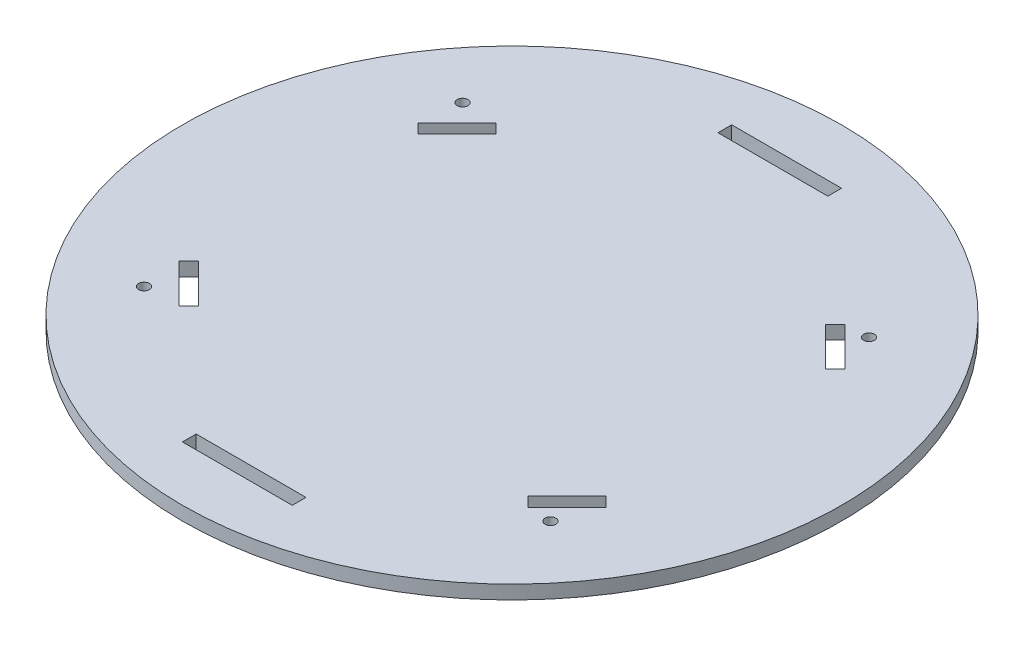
from build123d import *

# Parameters (mm, degrees)
SKETCH1_R                   = 76.2
EXTRUDE1_DEPTH              = 1.5875
CUT_EXTRUDE2_DEPTH          = 108.809835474
SKETCH5_W                   = 25.4
SKETCH5_H                   = 3.175
CUT_EXTRUDE3_DEPTH          = 108.809835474
F_40_0_098_DIAMETER_HOLE1_D = 2.4892


with BuildPart() as part:
    # Sketch1 → Extrude1 (new, symmetric)
    with BuildSketch(Plane(origin=(0, 0, 0), x_dir=(1, 0, 0), z_dir=(0, 1, 0))):
        with Locations(Location((0, 0, 0), (0, 0, 270))):
            Circle(SKETCH1_R)
    extrude(amount=EXTRUDE1_DEPTH, both=True)

    # Sketch4 → Cut-Extrude2 (cut, through all)
    with BuildSketch(Plane(origin=(0, 1.5875, 0), x_dir=(1, 0, 0), z_dir=(0, 1, 0))):
        Polygon((-40.34506403, 36.625320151), (-49.325320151, 27.64506403), (-47.080256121, 25.4), (-38.1, 34.380256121), align=None)
        Polygon((38.1, 34.380256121), (47.080256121, 25.4), (49.325320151, 27.64506403), (40.34506403, 36.625320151), align=None)
        Polygon((40.34506403, -36.625320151), (49.325320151, -27.64506403), (47.080256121, -25.4), (38.1, -34.380256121), align=None)
        Polygon((-38.1, -34.380256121), (-47.080256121, -25.4), (-49.325320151, -27.64506403), (-40.34506403, -36.625320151), align=None)
    extrude(amount=-CUT_EXTRUDE2_DEPTH, mode=Mode.SUBTRACT)

    # Sketch5 → Cut-Extrude3 (cut, through all)
    with BuildSketch(Plane(origin=(0, 1.5875, 0), x_dir=(1, 0, 0), z_dir=(0, 1, 0))):
        with Locations((0, -61.9125)):
            Rectangle(SKETCH5_W, SKETCH5_H)
        with Locations((0, 61.9125)):
            Rectangle(SKETCH5_W, SKETCH5_H)
    extrude(amount=-CUT_EXTRUDE3_DEPTH, mode=Mode.SUBTRACT)

    # 40 _0.098_ Diameter Hole1 (through all)
    with Locations(Plane(origin=(0, 1.5875, 0), x_dir=(-1, 0, 0), z_dir=(0, 1, 0))):
        with Locations((48.26, -36.83), (-45.72, -36.83), (-45.72, 36.83), (48.26, 36.83)):
            Hole(F_40_0_098_DIAMETER_HOLE1_D / 2)


solid = part.part
